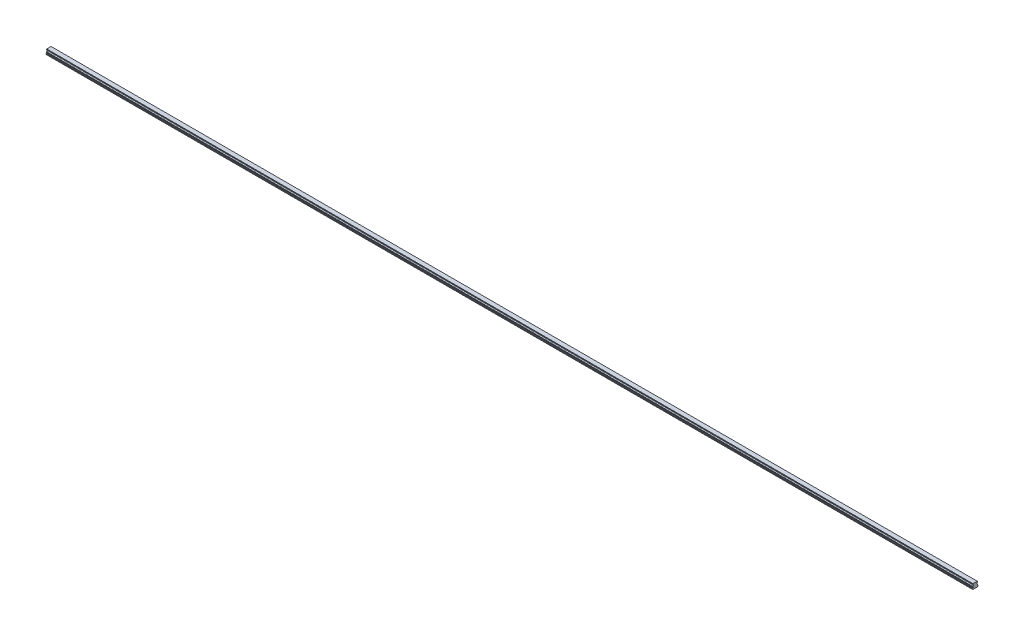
from build123d import *

# Parameters (mm, degrees)
BOSS_EXTRUDE1_DEPTH        = 4020
SKETCH3_R                  = 3
SKETCH3_R_2                = 2.5
CUT_EXTRUDE3_DEPTH         = 12
SKETCH3_2_R                = 2.5
CUT_EXTRUDE4_DEPTH         = 15
CHAMFER1_SIZE              = 0.5
LPATTERN4_COUNT            = 67
LPATTERN4_PITCH            = 60
CHAMFER1_OF_LPATTERN4_SIZE = 0.5


with BuildPart() as part:
    # Sketch1 → Boss-Extrude1 (new body)
    with BuildSketch(Plane(origin=(0, 0, 0), x_dir=(0, 0, -1), z_dir=(1, 0, 0))):
        with BuildLine():
            Line((9.375, 21.8), (-9.375, 21.8))
            Line((-9.375, 21.8), (-9.375, 20.756))
            Line((-9.375, 20.756), (-10, 19.415683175))
            Line((-10, 19.415683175), (-10, 17.685449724))
            ThreePointArc((-10, 17.685449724), (-7.2, 14.6), (-10, 11.514550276))
            Line((-10, 11.514550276), (-10, 9.784316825))
            Line((-10, 9.784316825), (-9.375, 8.444))
            Line((-9.375, 8.444), (-9.922688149, 6.4))
            Line((-9.922688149, 6.4), (-12.5, 5.489338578))
            Line((-12.5, 5.489338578), (-12.5, 2.65))
            Line((-12.5, 2.65), (-9.85, 0))
            Line((-9.85, 0), (-5.5, 0))
            Line((-5.5, 0), (-5, 0.5))
            Line((-5, 0.5), (5, 0.5))
            Line((5, 0.5), (5.5, 0))
            Line((5.5, 0), (9.85, 0))
            Line((9.85, 0), (12.5, 2.65))
            Line((12.5, 2.65), (12.5, 5.489338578))
            Line((12.5, 5.489338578), (9.922688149, 6.4))
            Line((9.922688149, 6.4), (9.375, 8.444))
            Line((9.375, 8.444), (10, 9.784316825))
            Line((10, 9.784316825), (10, 11.514550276))
            ThreePointArc((10, 11.514550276), (7.2, 14.6), (10, 17.685449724))
            Line((10, 17.685449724), (10, 19.415683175))
            Line((10, 19.415683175), (9.375, 20.756))
            Line((9.375, 20.756), (9.375, 21.8))
        make_face()
    extrude(amount=BOSS_EXTRUDE1_DEPTH)

    # Sketch3 → Cut-Extrude3 (cut)
    with BuildSketch(Plane.XZ):
        with Locations(Location((30, 0, 0), (0, 0, 270))):
            Circle(SKETCH3_R)
        with Locations(Location((30, 0, 0), (0, 0, 270))):
            Circle(SKETCH3_R_2, mode=Mode.SUBTRACT)
    cut_extrude3 = extrude(amount=-CUT_EXTRUDE3_DEPTH, mode=Mode.SUBTRACT)

    # Sketch3_2 → Cut-Extrude4 (cut)
    with BuildSketch(Plane.XZ):
        with Locations(Location((30, 0, 0), (0, 0, 270))):
            Circle(SKETCH3_2_R)
    cut_extrude4 = extrude(amount=-CUT_EXTRUDE4_DEPTH, mode=Mode.SUBTRACT)

    # Cut-Extrude5 cone 1 section (on through the dimple's axis) → Cut-Extrude5 (revolve, cut)
    with BuildSketch(Plane(origin=(30, 15, 0), x_dir=(0, 0, -1), z_dir=(1, 0, 0))):
        Polygon((0, 0), (2.5, 0), (0, 1.443375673), align=None)
    cut_extrude5 = revolve(axis=Axis((30, 15, 0), (0, 1, 0)), mode=Mode.SUBTRACT)

    # Chamfer1
    chamfer1_edges = [part.edges().sort_by_distance(p)[0] for p in [
        (30, 0.5, 3),
    ]]
    chamfer(chamfer1_edges, length=CHAMFER1_SIZE)

    # LPattern4: Cut-Extrude3, Cut-Extrude4, Cut-Extrude5 ×67
    with Locations(*[(i * LPATTERN4_PITCH, 0, 0) for i in range(1, LPATTERN4_COUNT)]):
        add(cut_extrude3, mode=Mode.SUBTRACT)
        add(cut_extrude4, mode=Mode.SUBTRACT)
        add(cut_extrude5, mode=Mode.SUBTRACT)

    # Chamfer1 of LPattern4
    chamfer1_of_lpattern4_edges = [part.edges().sort_by_distance(p)[0] for p in [
        (90, 0.5, 3),
        (150, 0.5, 3),
        (210, 0.5, 3),
        (270, 0.5, 3),
        (330, 0.5, 3),
        (390, 0.5, 3),
        (450, 0.5, 3),
        (510, 0.5, 3),
        (570, 0.5, 3),
        (630, 0.5, 3),
        (690, 0.5, 3),
        (750, 0.5, 3),
        (810, 0.5, 3),
        (870, 0.5, 3),
        (930, 0.5, 3),
        (990, 0.5, 3),
        (1050, 0.5, 3),
        (1110, 0.5, 3),
        (1170, 0.5, 3),
        (1230, 0.5, 3),
        (1290, 0.5, 3),
        (1350, 0.5, 3),
        (1410, 0.5, 3),
        (1470, 0.5, 3),
        (1530, 0.5, 3),
        (1590, 0.5, 3),
        (1650, 0.5, 3),
        (1710, 0.5, 3),
        (1770, 0.5, 3),
        (1830, 0.5, 3),
        (1890, 0.5, 3),
        (1950, 0.5, 3),
        (2010, 0.5, 3),
        (2070, 0.5, 3),
        (2130, 0.5, 3),
        (2190, 0.5, 3),
        (2250, 0.5, 3),
        (2310, 0.5, 3),
        (2370, 0.5, 3),
        (2430, 0.5, 3),
        (2490, 0.5, 3),
        (2550, 0.5, 3),
        (2610, 0.5, 3),
        (2670, 0.5, 3),
        (2730, 0.5, 3),
        (2790, 0.5, 3),
        (2850, 0.5, 3),
        (2910, 0.5, 3),
        (2970, 0.5, 3),
        (3030, 0.5, 3),
        (3090, 0.5, 3),
        (3150, 0.5, 3),
        (3210, 0.5, 3),
        (3270, 0.5, 3),
        (3330, 0.5, 3),
        (3390, 0.5, 3),
        (3450, 0.5, 3),
        (3510, 0.5, 3),
        (3570, 0.5, 3),
        (3630, 0.5, 3),
        (3690, 0.5, 3),
        (3750, 0.5, 3),
        (3810, 0.5, 3),
        (3870, 0.5, 3),
        (3930, 0.5, 3),
        (3990, 0.5, 3),
    ]]
    chamfer(chamfer1_of_lpattern4_edges, length=CHAMFER1_OF_LPATTERN4_SIZE)


solid = part.part
